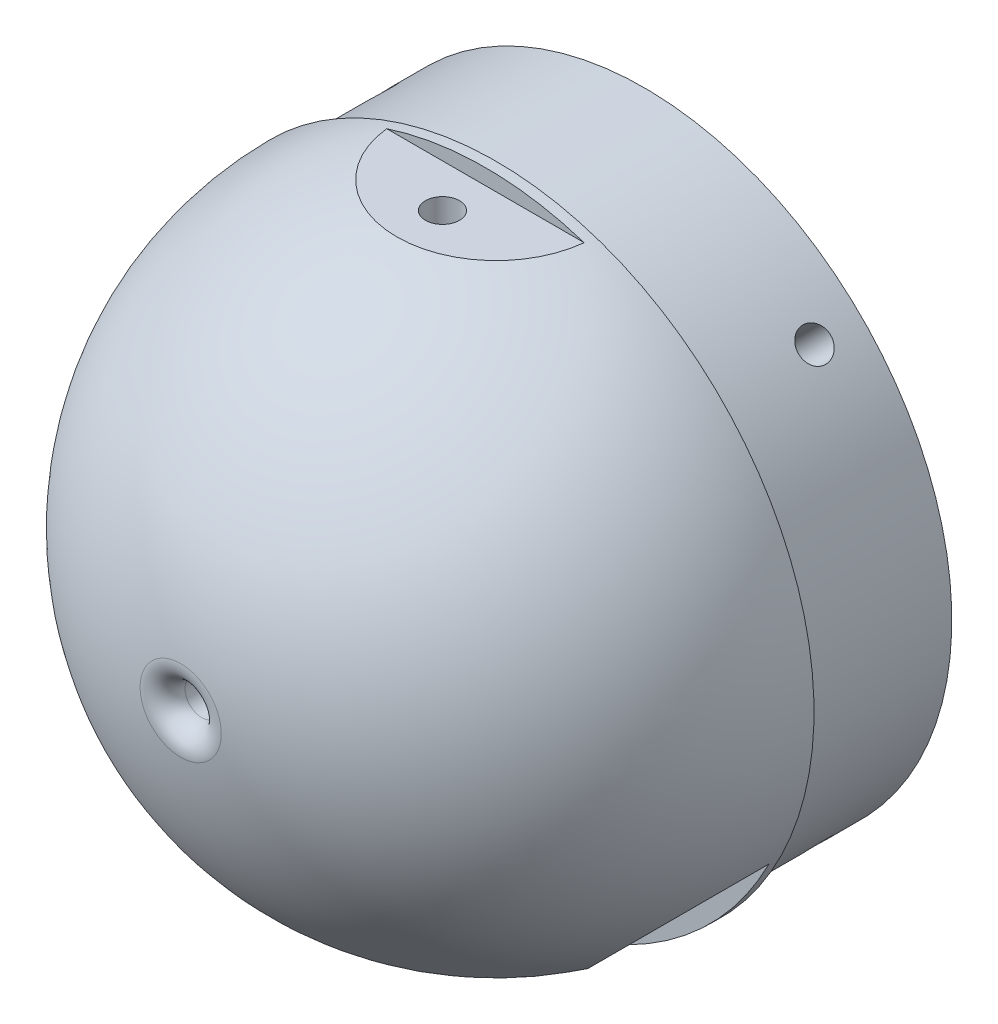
ISO-10303-21;
HEADER;
FILE_DESCRIPTION(('STEP AP214'),'2;1');
FILE_NAME('part.step','',(''),(''),'','','');
FILE_SCHEMA(('AUTOMOTIVE_DESIGN { 1 0 10303 214 1 1 1 1 }'));
ENDSEC;
DATA;
#1=APPLICATION_CONTEXT('core data for automotive mechanical design processes');
#2=APPLICATION_PROTOCOL_DEFINITION('international standard','automotive_design',2000,#1);
#3=PRODUCT_CONTEXT('',#1,'mechanical');
#4=PRODUCT('Part','Part','',(#3));
#5=PRODUCT_RELATED_PRODUCT_CATEGORY('part','',(#4));
#6=PRODUCT_DEFINITION_FORMATION('','',#4);
#7=PRODUCT_DEFINITION_CONTEXT('part definition',#1,'design');
#8=PRODUCT_DEFINITION('design','',#6,#7);
#9=PRODUCT_DEFINITION_SHAPE('','',#8);
#10=(LENGTH_UNIT() NAMED_UNIT(*) SI_UNIT(.MILLI.,.METRE.));
#11=(NAMED_UNIT(*) PLANE_ANGLE_UNIT() SI_UNIT($,.RADIAN.));
#12=(NAMED_UNIT(*) SI_UNIT($,.STERADIAN.) SOLID_ANGLE_UNIT());
#13=UNCERTAINTY_MEASURE_WITH_UNIT(LENGTH_MEASURE(1.E-05),#10,'distance_accuracy_value','');
#14=(GEOMETRIC_REPRESENTATION_CONTEXT(3) GLOBAL_UNCERTAINTY_ASSIGNED_CONTEXT((#13)) GLOBAL_UNIT_ASSIGNED_CONTEXT((#10,
#11,#12)) REPRESENTATION_CONTEXT('',''));
#15=CARTESIAN_POINT('',(0.,0.,0.));
#16=DIRECTION('',(0.,0.,1.));
#17=DIRECTION('',(1.,0.,0.));
#18=AXIS2_PLACEMENT_3D('',#15,#16,#17);
#19=CARTESIAN_POINT('',(0.,0.,-15.125));
#20=DIRECTION('',(0.,0.,1.));
#21=DIRECTION('',(0.,-1.,0.));
#22=AXIS2_PLACEMENT_3D('',#19,#20,#21);
#23=SPHERICAL_SURFACE('',#22,47.625);
#24=CARTESIAN_POINT('',(31.9876723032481,-31.9876723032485,-15.125));
#25=DIRECTION('',(0.707106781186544,-0.707106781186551,0.));
#26=DIRECTION('',(0.707106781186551,0.707106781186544,0.));
#27=AXIS2_PLACEMENT_3D('',#24,#25,#26);
#28=CIRCLE('',#27,14.8902070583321);
#29=CARTESIAN_POINT('',(21.5187155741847,-42.4566290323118,-13.5375));
#30=VERTEX_POINT('',#29);
#31=CARTESIAN_POINT('',(42.4566290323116,-21.5187155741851,-13.5375));
#32=VERTEX_POINT('',#31);
#33=EDGE_CURVE('E219',#30,#32,#28,.F.);
#34=ORIENTED_EDGE('',*,*,#33,.T.);
#35=CARTESIAN_POINT('',(0.,0.,-13.5375));
#36=DIRECTION('',(0.,0.,1.));
#37=DIRECTION('',(1.,0.,0.));
#38=AXIS2_PLACEMENT_3D('',#35,#36,#37);
#39=CIRCLE('',#38,47.5985343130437);
#40=EDGE_CURVE('E297',#32,#30,#39,.F.);
#41=ORIENTED_EDGE('',*,*,#40,.T.);
#42=EDGE_LOOP('',(#34,#41));
#43=FACE_BOUND('',#42,.T.);
#44=CARTESIAN_POINT('',(0.,0.,-13.5375));
#45=DIRECTION('',(0.,0.,-1.));
#46=DIRECTION('',(0.,1.,0.));
#47=AXIS2_PLACEMENT_3D('',#44,#45,#46);
#48=CIRCLE('',#47,47.5985343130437);
#49=CARTESIAN_POINT('',(14.785924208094,45.24375,-13.5375));
#50=VERTEX_POINT('',#49);
#51=CARTESIAN_POINT('',(-14.785924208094,45.24375,-13.5375));
#52=VERTEX_POINT('',#51);
#53=EDGE_CURVE('E220',#50,#52,#48,.F.);
#54=ORIENTED_EDGE('',*,*,#53,.F.);
#55=CARTESIAN_POINT('',(0.,45.24375,-15.125));
#56=DIRECTION('',(0.,-1.,0.));
#57=DIRECTION('',(0.,0.,-1.));
#58=AXIS2_PLACEMENT_3D('',#55,#56,#57);
#59=CIRCLE('',#58,14.8709014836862);
#60=EDGE_CURVE('E286',#52,#50,#59,.F.);
#61=ORIENTED_EDGE('',*,*,#60,.F.);
#62=EDGE_LOOP('',(#54,#61));
#63=FACE_BOUND('',#62,.T.);
#64=CARTESIAN_POINT('',(0.,0.,32.1102610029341));
#65=DIRECTION('',(0.,0.,-1.));
#66=DIRECTION('',(0.,1.,0.));
#67=AXIS2_PLACEMENT_3D('',#64,#65,#66);
#68=CIRCLE('',#67,6.08035714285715);
#69=CARTESIAN_POINT('',(0.,6.08035714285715,32.1102610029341));
#70=VERTEX_POINT('',#69);
#71=EDGE_CURVE('E281',#70,#70,#68,.T.);
#72=ORIENTED_EDGE('',*,*,#71,.T.);
#73=EDGE_LOOP('',(#72));
#74=FACE_BOUND('',#73,.T.);
#75=CARTESIAN_POINT('',(0.,0.,-15.125));
#76=DIRECTION('',(0.,0.,-1.));
#77=DIRECTION('',(-1.,0.,0.));
#78=AXIS2_PLACEMENT_3D('',#75,#76,#77);
#79=CIRCLE('',#78,47.625);
#80=CARTESIAN_POINT('',(-47.625,0.,-15.125));
#81=VERTEX_POINT('',#80);
#82=EDGE_CURVE('E260',#81,#81,#79,.F.);
#83=ORIENTED_EDGE('',*,*,#82,.T.);
#84=EDGE_LOOP('',(#83));
#85=FACE_BOUND('',#84,.T.);
#86=CARTESIAN_POINT('',(-31.9876723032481,-31.9876723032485,-15.125));
#87=DIRECTION('',(-0.707106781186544,-0.707106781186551,0.));
#88=DIRECTION('',(0.707106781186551,-0.707106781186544,0.));
#89=AXIS2_PLACEMENT_3D('',#86,#87,#88);
#90=CIRCLE('',#89,14.8902070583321);
#91=CARTESIAN_POINT('',(-42.4566290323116,-21.5187155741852,-13.5375));
#92=VERTEX_POINT('',#91);
#93=CARTESIAN_POINT('',(-21.5187155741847,-42.4566290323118,-13.5375));
#94=VERTEX_POINT('',#93);
#95=EDGE_CURVE('E50',#92,#94,#90,.F.);
#96=ORIENTED_EDGE('',*,*,#95,.T.);
#97=CARTESIAN_POINT('',(0.,0.,-13.5375));
#98=DIRECTION('',(0.,0.,1.));
#99=DIRECTION('',(1.,0.,0.));
#100=AXIS2_PLACEMENT_3D('',#97,#98,#99);
#101=CIRCLE('',#100,47.5985343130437);
#102=EDGE_CURVE('E12',#94,#92,#101,.F.);
#103=ORIENTED_EDGE('',*,*,#102,.T.);
#104=EDGE_LOOP('',(#96,#103));
#105=FACE_BOUND('',#104,.T.);
#106=ADVANCED_FACE('F42',(#43,#63,#74,#85,#105),#23,.T.);
#107=CARTESIAN_POINT('',(0.,47.625,-37.35));
#108=DIRECTION('',(0.,0.,1.));
#109=DIRECTION('',(1.,0.,0.));
#110=AXIS2_PLACEMENT_3D('',#107,#108,#109);
#111=PLANE('',#110);
#112=CARTESIAN_POINT('',(0.,0.,-37.35));
#113=DIRECTION('',(0.,0.,1.));
#114=DIRECTION('',(1.,0.,0.));
#115=AXIS2_PLACEMENT_3D('',#112,#113,#114);
#116=CIRCLE('',#115,4.);
#117=CARTESIAN_POINT('',(4.,0.,-37.35));
#118=VERTEX_POINT('',#117);
#119=EDGE_CURVE('E263',#118,#118,#116,.T.);
#120=ORIENTED_EDGE('',*,*,#119,.T.);
#121=EDGE_LOOP('',(#120));
#122=FACE_BOUND('',#121,.T.);
#123=CARTESIAN_POINT('',(0.,0.,-37.35));
#124=DIRECTION('',(0.,0.,-1.));
#125=DIRECTION('',(-1.,0.,0.));
#126=AXIS2_PLACEMENT_3D('',#123,#124,#125);
#127=CIRCLE('',#126,46.0375);
#128=CARTESIAN_POINT('',(-46.0375,0.,-37.35));
#129=VERTEX_POINT('',#128);
#130=EDGE_CURVE('E247',#129,#129,#127,.T.);
#131=ORIENTED_EDGE('',*,*,#130,.T.);
#132=EDGE_LOOP('',(#131));
#133=FACE_BOUND('',#132,.T.);
#134=ADVANCED_FACE('F165',(#122,#133),#111,.F.);
#135=CARTESIAN_POINT('',(0.,0.,32.476372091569));
#136=DIRECTION('',(0.,0.,1.));
#137=DIRECTION('',(0.,-1.,0.));
#138=AXIS2_PLACEMENT_3D('',#135,#136,#137);
#139=CYLINDRICAL_SURFACE('',#138,4.);
#140=CARTESIAN_POINT('',(0.,0.,-12.5));
#141=DIRECTION('',(0.,0.,1.));
#142=DIRECTION('',(0.,-1.,0.));
#143=AXIS2_PLACEMENT_3D('',#140,#141,#142);
#144=CIRCLE('',#143,4.);
#145=CARTESIAN_POINT('',(0.,-4.,-12.5));
#146=VERTEX_POINT('',#145);
#147=EDGE_CURVE('E275',#146,#146,#144,.T.);
#148=ORIENTED_EDGE('',*,*,#147,.T.);
#149=EDGE_LOOP('',(#148));
#150=FACE_BOUND('',#149,.T.);
#151=ORIENTED_EDGE('',*,*,#119,.F.);
#152=EDGE_LOOP('',(#151));
#153=FACE_BOUND('',#152,.T.);
#154=ADVANCED_FACE('F170',(#150,#153),#139,.F.);
#155=CARTESIAN_POINT('',(0.,0.,32.476372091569));
#156=DIRECTION('',(0.,0.,1.));
#157=DIRECTION('',(0.,-1.,0.));
#158=AXIS2_PLACEMENT_3D('',#155,#156,#157);
#159=CYLINDRICAL_SURFACE('',#158,2.50000000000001);
#160=CARTESIAN_POINT('',(0.,0.,28.9612436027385));
#161=DIRECTION('',(0.,0.,-1.));
#162=DIRECTION('',(0.,1.,0.));
#163=AXIS2_PLACEMENT_3D('',#160,#161,#162);
#164=CIRCLE('',#163,2.50000000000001);
#165=CARTESIAN_POINT('',(0.,2.50000000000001,28.9612436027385));
#166=VERTEX_POINT('',#165);
#167=EDGE_CURVE('E284',#166,#166,#164,.F.);
#168=ORIENTED_EDGE('',*,*,#167,.T.);
#169=EDGE_LOOP('',(#168));
#170=FACE_BOUND('',#169,.T.);
#171=CARTESIAN_POINT('',(0.,0.,-12.5));
#172=DIRECTION('',(0.,0.,1.));
#173=DIRECTION('',(0.,-1.,0.));
#174=AXIS2_PLACEMENT_3D('',#171,#172,#173);
#175=CIRCLE('',#174,2.50000000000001);
#176=CARTESIAN_POINT('',(0.,-2.50000000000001,-12.5));
#177=VERTEX_POINT('',#176);
#178=EDGE_CURVE('E278',#177,#177,#175,.T.);
#179=ORIENTED_EDGE('',*,*,#178,.F.);
#180=EDGE_LOOP('',(#179));
#181=FACE_BOUND('',#180,.T.);
#182=ADVANCED_FACE('F178',(#170,#181),#159,.F.);
#183=CARTESIAN_POINT('',(0.,4.,-12.5));
#184=DIRECTION('',(0.,0.,-1.));
#185=DIRECTION('',(0.,1.,0.));
#186=AXIS2_PLACEMENT_3D('',#183,#184,#185);
#187=PLANE('',#186);
#188=ORIENTED_EDGE('',*,*,#178,.T.);
#189=EDGE_LOOP('',(#188));
#190=FACE_BOUND('',#189,.T.);
#191=ORIENTED_EDGE('',*,*,#147,.F.);
#192=EDGE_LOOP('',(#191));
#193=FACE_BOUND('',#192,.T.);
#194=ADVANCED_FACE('F182',(#190,#193),#187,.T.);
#195=CARTESIAN_POINT('',(0.,0.,28.9612436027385));
#196=DIRECTION('',(0.,0.,-1.));
#197=DIRECTION('',(0.,1.,0.));
#198=AXIS2_PLACEMENT_3D('',#195,#196,#197);
#199=TOROIDAL_SURFACE('',#198,5.67500000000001,3.175);
#200=ORIENTED_EDGE('',*,*,#167,.F.);
#201=EDGE_LOOP('',(#200));
#202=FACE_BOUND('',#201,.T.);
#203=ORIENTED_EDGE('',*,*,#71,.F.);
#204=EDGE_LOOP('',(#203));
#205=FACE_BOUND('',#204,.T.);
#206=ADVANCED_FACE('F44',(#202,#205),#199,.T.);
#207=CARTESIAN_POINT('',(-25.4,51.59375,-13.5375));
#208=DIRECTION('',(0.,0.,-1.));
#209=DIRECTION('',(0.,1.,0.));
#210=AXIS2_PLACEMENT_3D('',#207,#208,#209);
#211=PLANE('',#210);
#212=ORIENTED_EDGE('',*,*,#53,.T.);
#213=DIRECTION('',(1.,0.,0.));
#214=VECTOR('',#213,1.);
#215=CARTESIAN_POINT('',(-25.4,45.24375,-13.5375));
#216=LINE('',#215,#214);
#217=EDGE_CURVE('E272',#52,#50,#216,.T.);
#218=ORIENTED_EDGE('',*,*,#217,.T.);
#219=EDGE_LOOP('',(#212,#218));
#220=FACE_BOUND('',#219,.T.);
#221=ADVANCED_FACE('F191',(#220),#211,.F.);
#222=CARTESIAN_POINT('',(-25.4,45.24375,11.8625));
#223=DIRECTION('',(0.,-1.,0.));
#224=DIRECTION('',(0.,0.,-1.));
#225=AXIS2_PLACEMENT_3D('',#222,#223,#224);
#226=PLANE('',#225);
#227=CARTESIAN_POINT('',(0.,45.24375,-7.10113999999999));
#228=DIRECTION('',(0.,1.,0.));
#229=DIRECTION('',(0.,0.,1.));
#230=AXIS2_PLACEMENT_3D('',#227,#228,#229);
#231=CIRCLE('',#230,2.55269999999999);
#232=CARTESIAN_POINT('',(0.,45.24375,-4.54844));
#233=VERTEX_POINT('',#232);
#234=EDGE_CURVE('E266',#233,#233,#231,.T.);
#235=ORIENTED_EDGE('',*,*,#234,.F.);
#236=EDGE_LOOP('',(#235));
#237=FACE_BOUND('',#236,.T.);
#238=ORIENTED_EDGE('',*,*,#60,.T.);
#239=ORIENTED_EDGE('',*,*,#217,.F.);
#240=EDGE_LOOP('',(#238,#239));
#241=FACE_BOUND('',#240,.T.);
#242=ADVANCED_FACE('F187',(#237,#241),#226,.F.);
#243=CARTESIAN_POINT('',(0.,26.19375,-7.10113999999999));
#244=DIRECTION('',(0.,1.,0.));
#245=DIRECTION('',(0.,0.,1.));
#246=AXIS2_PLACEMENT_3D('',#243,#244,#245);
#247=CONICAL_SURFACE('',#246,2.55269999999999,1.02974425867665);
#248=CARTESIAN_POINT('',(0.,24.6599330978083,-7.10113999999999));
#249=VERTEX_POINT('',#248);
#250=VERTEX_LOOP('',#249);
#251=FACE_BOUND('',#250,.T.);
#252=CARTESIAN_POINT('',(0.,26.19375,-7.10113999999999));
#253=DIRECTION('',(0.,1.,0.));
#254=DIRECTION('',(0.,0.,1.));
#255=AXIS2_PLACEMENT_3D('',#252,#253,#254);
#256=CIRCLE('',#255,2.55269999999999);
#257=CARTESIAN_POINT('',(0.,26.19375,-4.54844));
#258=VERTEX_POINT('',#257);
#259=EDGE_CURVE('E269',#258,#258,#256,.T.);
#260=ORIENTED_EDGE('',*,*,#259,.T.);
#261=EDGE_LOOP('',(#260));
#262=FACE_BOUND('',#261,.T.);
#263=ADVANCED_FACE('F190',(#251,#262),#247,.F.);
#264=CARTESIAN_POINT('',(0.,45.24375,-7.10113999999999));
#265=DIRECTION('',(0.,1.,0.));
#266=DIRECTION('',(0.,0.,1.));
#267=AXIS2_PLACEMENT_3D('',#264,#265,#266);
#268=CYLINDRICAL_SURFACE('',#267,2.55269999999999);
#269=ORIENTED_EDGE('',*,*,#259,.F.);
#270=EDGE_LOOP('',(#269));
#271=FACE_BOUND('',#270,.T.);
#272=ORIENTED_EDGE('',*,*,#234,.T.);
#273=EDGE_LOOP('',(#272));
#274=FACE_BOUND('',#273,.T.);
#275=ADVANCED_FACE('F198',(#271,#274),#268,.F.);
#276=CARTESIAN_POINT('',(0.,50.8,-15.125));
#277=DIRECTION('',(0.,0.,-1.));
#278=DIRECTION('',(-1.,0.,0.));
#279=AXIS2_PLACEMENT_3D('',#276,#277,#278);
#280=PLANE('',#279);
#281=ORIENTED_EDGE('',*,*,#82,.F.);
#282=EDGE_LOOP('',(#281));
#283=FACE_BOUND('',#282,.T.);
#284=CARTESIAN_POINT('',(0.,0.,-15.125));
#285=DIRECTION('',(0.,0.,-1.));
#286=DIRECTION('',(-1.,0.,0.));
#287=AXIS2_PLACEMENT_3D('',#284,#285,#286);
#288=CIRCLE('',#287,46.0375);
#289=CARTESIAN_POINT('',(-46.0375,0.,-15.125));
#290=VERTEX_POINT('',#289);
#291=EDGE_CURVE('E251',#290,#290,#288,.F.);
#292=ORIENTED_EDGE('',*,*,#291,.T.);
#293=EDGE_LOOP('',(#292));
#294=FACE_BOUND('',#293,.T.);
#295=ADVANCED_FACE('F202',(#283,#294),#280,.T.);
#296=CARTESIAN_POINT('',(0.,0.,129.995938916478));
#297=DIRECTION('',(0.,0.,-1.));
#298=DIRECTION('',(-1.,0.,0.));
#299=AXIS2_PLACEMENT_3D('',#296,#297,#298);
#300=CYLINDRICAL_SURFACE('',#299,46.0375);
#301=CARTESIAN_POINT('',(-30.8024335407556,-34.2149308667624,-30.2786400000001));
#302=CARTESIAN_POINT('',(-30.8024383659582,-34.2149272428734,-30.1432006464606));
#303=CARTESIAN_POINT('',(-30.8109516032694,-34.2072683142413,-30.0076654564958));
#304=CARTESIAN_POINT('',(-30.8447564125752,-34.1767889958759,-29.7403346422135));
#305=CARTESIAN_POINT('',(-30.8700677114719,-34.1539507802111,-29.6085436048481));
#306=CARTESIAN_POINT('',(-30.9366366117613,-34.0936640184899,-29.3526122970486));
#307=CARTESIAN_POINT('',(-30.97788603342,-34.0562229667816,-29.2284681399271));
#308=CARTESIAN_POINT('',(-31.0749871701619,-33.9676445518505,-28.9913154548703));
#309=CARTESIAN_POINT('',(-31.130835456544,-33.9165104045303,-28.8783043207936));
#310=CARTESIAN_POINT('',(-31.2554184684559,-33.8017363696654,-28.6664680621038));
#311=CARTESIAN_POINT('',(-31.3241655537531,-33.7380844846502,-28.5676567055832));
#312=CARTESIAN_POINT('',(-31.4723537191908,-33.5998898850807,-28.3871423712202));
#313=CARTESIAN_POINT('',(-31.5517952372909,-33.5253467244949,-28.3054400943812));
#314=CARTESIAN_POINT('',(-31.7189638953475,-33.3672288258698,-28.1614244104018));
#315=CARTESIAN_POINT('',(-31.8066956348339,-33.2836490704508,-28.0991218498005));
#316=CARTESIAN_POINT('',(-31.987743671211,-33.1096874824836,-27.9957437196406));
#317=CARTESIAN_POINT('',(-32.081059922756,-33.0193057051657,-27.9546679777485));
#318=CARTESIAN_POINT('',(-32.2704128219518,-32.8342711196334,-27.8949461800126));
#319=CARTESIAN_POINT('',(-32.3664468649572,-32.7396223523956,-27.8762793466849));
#320=CARTESIAN_POINT('',(-32.5585287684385,-32.5486090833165,-27.8618411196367));
#321=CARTESIAN_POINT('',(-32.6545766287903,-32.4522445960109,-27.8660695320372));
#322=CARTESIAN_POINT('',(-32.8438741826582,-32.2606487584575,-27.8972845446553));
#323=CARTESIAN_POINT('',(-32.9371265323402,-32.1654163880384,-27.9242487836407));
#324=CARTESIAN_POINT('',(-33.1183710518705,-31.9787716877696,-28.0001353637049));
#325=CARTESIAN_POINT('',(-33.2063631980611,-31.887359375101,-28.0490578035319));
#326=CARTESIAN_POINT('',(-33.3747830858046,-31.7110414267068,-28.1674975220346));
#327=CARTESIAN_POINT('',(-33.4552070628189,-31.6261390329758,-28.2370249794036));
#328=CARTESIAN_POINT('',(-33.6063579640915,-31.4654778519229,-28.3946936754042));
#329=CARTESIAN_POINT('',(-33.6770848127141,-31.3897191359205,-28.4828350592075));
#330=CARTESIAN_POINT('',(-33.8071343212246,-31.2496119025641,-28.6753559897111));
#331=CARTESIAN_POINT('',(-33.866443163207,-31.1852772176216,-28.7797549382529));
#332=CARTESIAN_POINT('',(-33.9720815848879,-31.0701657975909,-29.001759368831));
#333=CARTESIAN_POINT('',(-34.0184111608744,-31.0193890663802,-29.1193648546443));
#334=CARTESIAN_POINT('',(-34.0969626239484,-30.9330239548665,-29.36445588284));
#335=CARTESIAN_POINT('',(-34.1291839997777,-30.8974361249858,-29.4919417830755));
#336=CARTESIAN_POINT('',(-34.1787379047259,-30.8426110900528,-29.7531693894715));
#337=CARTESIAN_POINT('',(-34.1960705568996,-30.8233737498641,-29.8869110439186));
#338=CARTESIAN_POINT('',(-34.2154193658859,-30.8018943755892,-30.1566833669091));
#339=CARTESIAN_POINT('',(-34.2174537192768,-30.7996321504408,-30.292711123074));
#340=CARTESIAN_POINT('',(-34.206205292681,-30.8121241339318,-30.5633440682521));
#341=CARTESIAN_POINT('',(-34.1929225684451,-30.8268782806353,-30.6979492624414));
#342=CARTESIAN_POINT('',(-34.1513700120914,-30.8729053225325,-30.9618397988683));
#343=CARTESIAN_POINT('',(-34.1231085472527,-30.904168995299,-31.0911280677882));
#344=CARTESIAN_POINT('',(-34.0522827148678,-30.9821917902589,-31.3408049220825));
#345=CARTESIAN_POINT('',(-34.009718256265,-31.0289510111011,-31.4611934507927));
#346=CARTESIAN_POINT('',(-33.9112710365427,-31.1365123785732,-31.6897782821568));
#347=CARTESIAN_POINT('',(-33.8553757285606,-31.1973277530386,-31.7979629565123));
#348=CARTESIAN_POINT('',(-33.7316636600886,-31.3310476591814,-31.9989521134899));
#349=CARTESIAN_POINT('',(-33.6638468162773,-31.4039522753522,-32.0917564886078));
#350=CARTESIAN_POINT('',(-33.5179226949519,-31.5596520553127,-32.2594419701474));
#351=CARTESIAN_POINT('',(-33.4398054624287,-31.6424567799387,-32.3343055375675));
#352=CARTESIAN_POINT('',(-33.275346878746,-31.8153565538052,-32.4638643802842));
#353=CARTESIAN_POINT('',(-33.1890055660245,-31.9054515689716,-32.5185597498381));
#354=CARTESIAN_POINT('',(-33.0104365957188,-32.0901692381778,-32.6061989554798));
#355=CARTESIAN_POINT('',(-32.9182119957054,-32.1847895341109,-32.6391539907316));
#356=CARTESIAN_POINT('',(-32.7303569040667,-32.375810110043,-32.68241372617));
#357=CARTESIAN_POINT('',(-32.6347264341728,-32.472210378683,-32.6927185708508));
#358=CARTESIAN_POINT('',(-32.4428648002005,-32.6638989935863,-32.6903840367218));
#359=CARTESIAN_POINT('',(-32.3466344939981,-32.7591885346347,-32.6777721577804));
#360=CARTESIAN_POINT('',(-32.1562313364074,-32.9461074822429,-32.6300190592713));
#361=CARTESIAN_POINT('',(-32.0620584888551,-33.0377368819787,-32.5948777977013));
#362=CARTESIAN_POINT('',(-31.8785465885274,-33.2148453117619,-32.5030692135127));
#363=CARTESIAN_POINT('',(-31.789207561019,-33.3003243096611,-32.4464017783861));
#364=CARTESIAN_POINT('',(-31.6180547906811,-33.4628744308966,-32.3131539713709));
#365=CARTESIAN_POINT('',(-31.5362408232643,-33.5399458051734,-32.2365741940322));
#366=CARTESIAN_POINT('',(-31.3825593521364,-33.6837866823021,-32.0655762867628));
#367=CARTESIAN_POINT('',(-31.3107027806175,-33.7505448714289,-31.9711388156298));
#368=CARTESIAN_POINT('',(-31.1792726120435,-33.8720001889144,-31.767122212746));
#369=CARTESIAN_POINT('',(-31.1197020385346,-33.9266943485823,-31.6575393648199));
#370=CARTESIAN_POINT('',(-31.0147093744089,-34.0227025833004,-31.4262496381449));
#371=CARTESIAN_POINT('',(-30.9693016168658,-34.0640031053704,-31.3045306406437));
#372=CARTESIAN_POINT('',(-30.8942259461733,-34.1321080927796,-31.0526016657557));
#373=CARTESIAN_POINT('',(-30.8645394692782,-34.1589296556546,-30.9224019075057));
#374=CARTESIAN_POINT('',(-30.8296478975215,-34.1904156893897,-30.7059361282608));
#375=CARTESIAN_POINT('',(-30.8194571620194,-34.1995987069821,-30.6210717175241));
#376=CARTESIAN_POINT('',(-30.8058484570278,-34.2118574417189,-30.4503643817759));
#377=CARTESIAN_POINT('',(-30.8024304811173,-34.2149331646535,-30.3645214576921));
#378=CARTESIAN_POINT('',(-30.8024335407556,-34.2149308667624,-30.2786400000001));
#379=B_SPLINE_CURVE_WITH_KNOTS('',3,(#301,#302,#303,#304,#305,#306,#307,#308,#309,#310,#311,
#312,#313,#314,#315,#316,#317,#318,#319,#320,#321,#322,#323,#324,#325,#326,#327,#328,#329,#330,
#331,#332,#333,#334,#335,#336,#337,#338,#339,#340,#341,#342,#343,#344,#345,#346,#347,#348,#349,
#350,#351,#352,#353,#354,#355,#356,#357,#358,#359,#360,#361,#362,#363,#364,#365,#366,#367,#368,
#369,#370,#371,#372,#373,#374,#375,#376,#377,#378),.UNSPECIFIED.,.T.,.F.,(4,2,2,2,2,2,2,2,2,2,2,
2,2,2,2,2,2,2,2,2,2,2,2,2,2,2,2,2,2,2,2,2,2,2,2,2,2,2,4),(0.,0.406004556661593,
0.812486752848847,1.21876061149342,1.62493913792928,2.03150887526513,2.43809526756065,
2.84490857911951,3.251718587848,3.65815111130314,4.06458019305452,4.4706100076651,
4.87664164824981,5.28287420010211,5.68910992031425,6.09583421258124,6.50255862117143,
6.90929776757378,7.3160335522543,7.72228546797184,8.12853590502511,8.53455964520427,
8.94058597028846,9.34699596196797,9.7534087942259,10.1602173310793,10.567023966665,
10.973620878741,11.3802151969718,11.7863219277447,12.1924294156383,12.5985390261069,
13.0046365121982,13.4111763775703,13.8178161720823,14.224866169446,14.6314344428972,
14.8888802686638,15.1463258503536),.UNSPECIFIED.);
#380=CARTESIAN_POINT('',(-30.8024335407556,-34.2149308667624,-30.2786400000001));
#381=VERTEX_POINT('',#380);
#382=EDGE_CURVE('E127',#381,#381,#379,.T.);
#383=ORIENTED_EDGE('',*,*,#382,.F.);
#384=EDGE_LOOP('',(#383));
#385=FACE_BOUND('',#384,.T.);
#386=CARTESIAN_POINT('',(-34.2149308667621,30.802433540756,-30.2786400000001));
#387=CARTESIAN_POINT('',(-34.214927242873,30.8024383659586,-30.1432006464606));
#388=CARTESIAN_POINT('',(-34.207268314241,30.8109516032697,-30.0076654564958));
#389=CARTESIAN_POINT('',(-34.1767889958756,30.8447564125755,-29.7403346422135));
#390=CARTESIAN_POINT('',(-34.1539507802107,30.8700677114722,-29.6085436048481));
#391=CARTESIAN_POINT('',(-34.0936640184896,30.9366366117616,-29.3526122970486));
#392=CARTESIAN_POINT('',(-34.0562229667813,30.9778860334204,-29.2284681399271));
#393=CARTESIAN_POINT('',(-33.9676445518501,31.0749871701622,-28.9913154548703));
#394=CARTESIAN_POINT('',(-33.91651040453,31.1308354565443,-28.8783043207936));
#395=CARTESIAN_POINT('',(-33.8017363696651,31.2554184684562,-28.6664680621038));
#396=CARTESIAN_POINT('',(-33.7380844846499,31.3241655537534,-28.5676567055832));
#397=CARTESIAN_POINT('',(-33.5998898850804,31.4723537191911,-28.3871423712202));
#398=CARTESIAN_POINT('',(-33.5253467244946,31.5517952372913,-28.3054400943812));
#399=CARTESIAN_POINT('',(-33.3672288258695,31.7189638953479,-28.1614244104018));
#400=CARTESIAN_POINT('',(-33.2836490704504,31.8066956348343,-28.0991218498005));
#401=CARTESIAN_POINT('',(-33.1096874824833,31.9877436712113,-27.9957437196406));
#402=CARTESIAN_POINT('',(-33.0193057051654,32.0810599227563,-27.9546679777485));
#403=CARTESIAN_POINT('',(-32.8342711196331,32.2704128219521,-27.8949461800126));
#404=CARTESIAN_POINT('',(-32.7396223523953,32.3664468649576,-27.8762793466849));
#405=CARTESIAN_POINT('',(-32.5486090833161,32.5585287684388,-27.8618411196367));
#406=CARTESIAN_POINT('',(-32.4522445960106,32.6545766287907,-27.8660695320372));
#407=CARTESIAN_POINT('',(-32.2606487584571,32.8438741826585,-27.8972845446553));
#408=CARTESIAN_POINT('',(-32.1654163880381,32.9371265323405,-27.9242487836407));
#409=CARTESIAN_POINT('',(-31.9787716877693,33.1183710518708,-28.0001353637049));
#410=CARTESIAN_POINT('',(-31.8873593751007,33.2063631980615,-28.0490578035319));
#411=CARTESIAN_POINT('',(-31.7110414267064,33.374783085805,-28.1674975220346));
#412=CARTESIAN_POINT('',(-31.6261390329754,33.4552070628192,-28.2370249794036));
#413=CARTESIAN_POINT('',(-31.4654778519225,33.6063579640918,-28.3946936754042));
#414=CARTESIAN_POINT('',(-31.3897191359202,33.6770848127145,-28.4828350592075));
#415=CARTESIAN_POINT('',(-31.2496119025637,33.8071343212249,-28.6753559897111));
#416=CARTESIAN_POINT('',(-31.1852772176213,33.8664431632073,-28.7797549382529));
#417=CARTESIAN_POINT('',(-31.0701657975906,33.9720815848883,-29.001759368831));
#418=CARTESIAN_POINT('',(-31.0193890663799,34.0184111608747,-29.1193648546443));
#419=CARTESIAN_POINT('',(-30.9330239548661,34.0969626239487,-29.36445588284));
#420=CARTESIAN_POINT('',(-30.8974361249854,34.1291839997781,-29.4919417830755));
#421=CARTESIAN_POINT('',(-30.8426110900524,34.1787379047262,-29.7531693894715));
#422=CARTESIAN_POINT('',(-30.8233737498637,34.1960705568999,-29.8869110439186));
#423=CARTESIAN_POINT('',(-30.8018943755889,34.2154193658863,-30.1566833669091));
#424=CARTESIAN_POINT('',(-30.7996321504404,34.2174537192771,-30.292711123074));
#425=CARTESIAN_POINT('',(-30.8121241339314,34.2062052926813,-30.5633440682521));
#426=CARTESIAN_POINT('',(-30.826878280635,34.1929225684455,-30.6979492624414));
#427=CARTESIAN_POINT('',(-30.8729053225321,34.1513700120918,-30.9618397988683));
#428=CARTESIAN_POINT('',(-30.9041689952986,34.123108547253,-31.0911280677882));
#429=CARTESIAN_POINT('',(-30.9821917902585,34.0522827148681,-31.3408049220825));
#430=CARTESIAN_POINT('',(-31.0289510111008,34.0097182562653,-31.4611934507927));
#431=CARTESIAN_POINT('',(-31.1365123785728,33.9112710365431,-31.6897782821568));
#432=CARTESIAN_POINT('',(-31.1973277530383,33.8553757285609,-31.7979629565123));
#433=CARTESIAN_POINT('',(-31.331047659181,33.731663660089,-31.9989521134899));
#434=CARTESIAN_POINT('',(-31.4039522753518,33.6638468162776,-32.0917564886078));
#435=CARTESIAN_POINT('',(-31.5596520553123,33.5179226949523,-32.2594419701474));
#436=CARTESIAN_POINT('',(-31.6424567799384,33.439805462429,-32.3343055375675));
#437=CARTESIAN_POINT('',(-31.8153565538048,33.2753468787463,-32.4638643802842));
#438=CARTESIAN_POINT('',(-31.9054515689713,33.1890055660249,-32.5185597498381));
#439=CARTESIAN_POINT('',(-32.0901692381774,33.0104365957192,-32.6061989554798));
#440=CARTESIAN_POINT('',(-32.1847895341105,32.9182119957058,-32.6391539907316));
#441=CARTESIAN_POINT('',(-32.3758101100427,32.7303569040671,-32.68241372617));
#442=CARTESIAN_POINT('',(-32.4722103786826,32.6347264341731,-32.6927185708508));
#443=CARTESIAN_POINT('',(-32.663898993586,32.4428648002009,-32.6903840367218));
#444=CARTESIAN_POINT('',(-32.7591885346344,32.3466344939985,-32.6777721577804));
#445=CARTESIAN_POINT('',(-32.9461074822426,32.1562313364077,-32.6300190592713));
#446=CARTESIAN_POINT('',(-33.0377368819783,32.0620584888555,-32.5948777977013));
#447=CARTESIAN_POINT('',(-33.2148453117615,31.8785465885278,-32.5030692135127));
#448=CARTESIAN_POINT('',(-33.3003243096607,31.7892075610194,-32.4464017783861));
#449=CARTESIAN_POINT('',(-33.4628744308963,31.6180547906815,-32.3131539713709));
#450=CARTESIAN_POINT('',(-33.5399458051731,31.5362408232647,-32.2365741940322));
#451=CARTESIAN_POINT('',(-33.6837866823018,31.3825593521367,-32.0655762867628));
#452=CARTESIAN_POINT('',(-33.7505448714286,31.3107027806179,-31.9711388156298));
#453=CARTESIAN_POINT('',(-33.8720001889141,31.1792726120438,-31.767122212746));
#454=CARTESIAN_POINT('',(-33.9266943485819,31.119702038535,-31.6575393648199));
#455=CARTESIAN_POINT('',(-34.0227025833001,31.0147093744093,-31.4262496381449));
#456=CARTESIAN_POINT('',(-34.0640031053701,30.9693016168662,-31.3045306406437));
#457=CARTESIAN_POINT('',(-34.1321080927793,30.8942259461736,-31.0526016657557));
#458=CARTESIAN_POINT('',(-34.1589296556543,30.8645394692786,-30.9224019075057));
#459=CARTESIAN_POINT('',(-34.1904156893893,30.8296478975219,-30.7059361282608));
#460=CARTESIAN_POINT('',(-34.1995987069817,30.8194571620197,-30.6210717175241));
#461=CARTESIAN_POINT('',(-34.2118574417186,30.8058484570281,-30.4503643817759));
#462=CARTESIAN_POINT('',(-34.2149331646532,30.8024304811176,-30.3645214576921));
#463=CARTESIAN_POINT('',(-34.2149308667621,30.802433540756,-30.2786400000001));
#464=B_SPLINE_CURVE_WITH_KNOTS('',3,(#386,#387,#388,#389,#390,#391,#392,#393,#394,#395,#396,
#397,#398,#399,#400,#401,#402,#403,#404,#405,#406,#407,#408,#409,#410,#411,#412,#413,#414,#415,
#416,#417,#418,#419,#420,#421,#422,#423,#424,#425,#426,#427,#428,#429,#430,#431,#432,#433,#434,
#435,#436,#437,#438,#439,#440,#441,#442,#443,#444,#445,#446,#447,#448,#449,#450,#451,#452,#453,
#454,#455,#456,#457,#458,#459,#460,#461,#462,#463),.UNSPECIFIED.,.T.,.F.,(4,2,2,2,2,2,2,2,2,2,2,
2,2,2,2,2,2,2,2,2,2,2,2,2,2,2,2,2,2,2,2,2,2,2,2,2,2,2,4),(0.,0.406004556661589,
0.812486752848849,1.21876061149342,1.62493913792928,2.03150887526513,2.43809526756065,
2.84490857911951,3.251718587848,3.65815111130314,4.06458019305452,4.4706100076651,
4.87664164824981,5.28287420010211,5.68910992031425,6.09583421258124,6.50255862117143,
6.90929776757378,7.3160335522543,7.72228546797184,8.12853590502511,8.53455964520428,
8.94058597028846,9.34699596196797,9.75340879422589,10.1602173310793,10.567023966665,
10.973620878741,11.3802151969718,11.7863219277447,12.1924294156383,12.5985390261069,
13.0046365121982,13.4111763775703,13.8178161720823,14.224866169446,14.6314344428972,
14.8888802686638,15.1463258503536),.UNSPECIFIED.);
#465=CARTESIAN_POINT('',(-34.2149308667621,30.802433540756,-30.2786400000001));
#466=VERTEX_POINT('',#465);
#467=EDGE_CURVE('E672',#466,#466,#464,.T.);
#468=ORIENTED_EDGE('',*,*,#467,.F.);
#469=EDGE_LOOP('',(#468));
#470=FACE_BOUND('',#469,.T.);
#471=CARTESIAN_POINT('',(30.8024335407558,34.2149308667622,-30.2786400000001));
#472=CARTESIAN_POINT('',(30.8024383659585,34.2149272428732,-30.1432006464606));
#473=CARTESIAN_POINT('',(30.8109516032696,34.2072683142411,-30.0076654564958));
#474=CARTESIAN_POINT('',(30.8447564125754,34.1767889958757,-29.7403346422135));
#475=CARTESIAN_POINT('',(30.8700677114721,34.1539507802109,-29.6085436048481));
#476=CARTESIAN_POINT('',(30.9366366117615,34.0936640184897,-29.3526122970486));
#477=CARTESIAN_POINT('',(30.9778860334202,34.0562229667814,-29.2284681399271));
#478=CARTESIAN_POINT('',(31.0749871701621,33.9676445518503,-28.9913154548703));
#479=CARTESIAN_POINT('',(31.1308354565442,33.9165104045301,-28.8783043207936));
#480=CARTESIAN_POINT('',(31.2554184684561,33.8017363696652,-28.6664680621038));
#481=CARTESIAN_POINT('',(31.3241655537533,33.73808448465,-28.5676567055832));
#482=CARTESIAN_POINT('',(31.472353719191,33.5998898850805,-28.3871423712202));
#483=CARTESIAN_POINT('',(31.5517952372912,33.5253467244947,-28.3054400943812));
#484=CARTESIAN_POINT('',(31.7189638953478,33.3672288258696,-28.1614244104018));
#485=CARTESIAN_POINT('',(31.8066956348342,33.2836490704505,-28.0991218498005));
#486=CARTESIAN_POINT('',(31.9877436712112,33.1096874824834,-27.9957437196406));
#487=CARTESIAN_POINT('',(32.0810599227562,33.0193057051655,-27.9546679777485));
#488=CARTESIAN_POINT('',(32.270412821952,32.8342711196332,-27.8949461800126));
#489=CARTESIAN_POINT('',(32.3664468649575,32.7396223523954,-27.8762793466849));
#490=CARTESIAN_POINT('',(32.5585287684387,32.5486090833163,-27.8618411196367));
#491=CARTESIAN_POINT('',(32.6545766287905,32.4522445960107,-27.8660695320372));
#492=CARTESIAN_POINT('',(32.8438741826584,32.2606487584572,-27.8972845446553));
#493=CARTESIAN_POINT('',(32.9371265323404,32.1654163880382,-27.9242487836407));
#494=CARTESIAN_POINT('',(33.1183710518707,31.9787716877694,-28.0001353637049));
#495=CARTESIAN_POINT('',(33.2063631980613,31.8873593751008,-28.0490578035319));
#496=CARTESIAN_POINT('',(33.3747830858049,31.7110414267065,-28.1674975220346));
#497=CARTESIAN_POINT('',(33.4552070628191,31.6261390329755,-28.2370249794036));
#498=CARTESIAN_POINT('',(33.6063579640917,31.4654778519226,-28.3946936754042));
#499=CARTESIAN_POINT('',(33.6770848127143,31.3897191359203,-28.4828350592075));
#500=CARTESIAN_POINT('',(33.8071343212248,31.2496119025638,-28.6753559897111));
#501=CARTESIAN_POINT('',(33.8664431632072,31.1852772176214,-28.7797549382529));
#502=CARTESIAN_POINT('',(33.9720815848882,31.0701657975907,-29.001759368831));
#503=CARTESIAN_POINT('',(34.0184111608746,31.01938906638,-29.1193648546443));
#504=CARTESIAN_POINT('',(34.0969626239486,30.9330239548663,-29.36445588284));
#505=CARTESIAN_POINT('',(34.129183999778,30.8974361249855,-29.4919417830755));
#506=CARTESIAN_POINT('',(34.1787379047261,30.8426110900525,-29.7531693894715));
#507=CARTESIAN_POINT('',(34.1960705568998,30.8233737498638,-29.8869110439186));
#508=CARTESIAN_POINT('',(34.2154193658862,30.801894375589,-30.1566833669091));
#509=CARTESIAN_POINT('',(34.217453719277,30.7996321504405,-30.292711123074));
#510=CARTESIAN_POINT('',(34.2062052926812,30.8121241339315,-30.5633440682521));
#511=CARTESIAN_POINT('',(34.1929225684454,30.8268782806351,-30.6979492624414));
#512=CARTESIAN_POINT('',(34.1513700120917,30.8729053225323,-30.9618397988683));
#513=CARTESIAN_POINT('',(34.1231085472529,30.9041689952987,-31.0911280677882));
#514=CARTESIAN_POINT('',(34.052282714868,30.9821917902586,-31.3408049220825));
#515=CARTESIAN_POINT('',(34.0097182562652,31.0289510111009,-31.4611934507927));
#516=CARTESIAN_POINT('',(33.9112710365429,31.1365123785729,-31.6897782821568));
#517=CARTESIAN_POINT('',(33.8553757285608,31.1973277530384,-31.7979629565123));
#518=CARTESIAN_POINT('',(33.7316636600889,31.3310476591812,-31.9989521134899));
#519=CARTESIAN_POINT('',(33.6638468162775,31.4039522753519,-32.0917564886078));
#520=CARTESIAN_POINT('',(33.5179226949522,31.5596520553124,-32.2594419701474));
#521=CARTESIAN_POINT('',(33.4398054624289,31.6424567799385,-32.3343055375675));
#522=CARTESIAN_POINT('',(33.2753468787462,31.815356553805,-32.4638643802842));
#523=CARTESIAN_POINT('',(33.1890055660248,31.9054515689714,-32.5185597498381));
#524=CARTESIAN_POINT('',(33.0104365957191,32.0901692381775,-32.6061989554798));
#525=CARTESIAN_POINT('',(32.9182119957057,32.1847895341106,-32.6391539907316));
#526=CARTESIAN_POINT('',(32.730356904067,32.3758101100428,-32.68241372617));
#527=CARTESIAN_POINT('',(32.634726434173,32.4722103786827,-32.6927185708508));
#528=CARTESIAN_POINT('',(32.4428648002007,32.6638989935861,-32.6903840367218));
#529=CARTESIAN_POINT('',(32.3466344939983,32.7591885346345,-32.6777721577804));
#530=CARTESIAN_POINT('',(32.1562313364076,32.9461074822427,-32.6300190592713));
#531=CARTESIAN_POINT('',(32.0620584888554,33.0377368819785,-32.5948777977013));
#532=CARTESIAN_POINT('',(31.8785465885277,33.2148453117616,-32.5030692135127));
#533=CARTESIAN_POINT('',(31.7892075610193,33.3003243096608,-32.4464017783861));
#534=CARTESIAN_POINT('',(31.6180547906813,33.4628744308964,-32.3131539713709));
#535=CARTESIAN_POINT('',(31.5362408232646,33.5399458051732,-32.2365741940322));
#536=CARTESIAN_POINT('',(31.3825593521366,33.6837866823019,-32.0655762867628));
#537=CARTESIAN_POINT('',(31.3107027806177,33.7505448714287,-31.9711388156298));
#538=CARTESIAN_POINT('',(31.1792726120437,33.8720001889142,-31.767122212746));
#539=CARTESIAN_POINT('',(31.1197020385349,33.9266943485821,-31.6575393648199));
#540=CARTESIAN_POINT('',(31.0147093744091,34.0227025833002,-31.4262496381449));
#541=CARTESIAN_POINT('',(30.9693016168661,34.0640031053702,-31.3045306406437));
#542=CARTESIAN_POINT('',(30.8942259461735,34.1321080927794,-31.0526016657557));
#543=CARTESIAN_POINT('',(30.8645394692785,34.1589296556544,-30.9224019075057));
#544=CARTESIAN_POINT('',(30.8296478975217,34.1904156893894,-30.7059361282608));
#545=CARTESIAN_POINT('',(30.8194571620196,34.1995987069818,-30.6210717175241));
#546=CARTESIAN_POINT('',(30.805848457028,34.2118574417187,-30.4503643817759));
#547=CARTESIAN_POINT('',(30.8024304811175,34.2149331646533,-30.3645214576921));
#548=CARTESIAN_POINT('',(30.8024335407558,34.2149308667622,-30.2786400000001));
#549=B_SPLINE_CURVE_WITH_KNOTS('',3,(#471,#472,#473,#474,#475,#476,#477,#478,#479,#480,#481,
#482,#483,#484,#485,#486,#487,#488,#489,#490,#491,#492,#493,#494,#495,#496,#497,#498,#499,#500,
#501,#502,#503,#504,#505,#506,#507,#508,#509,#510,#511,#512,#513,#514,#515,#516,#517,#518,#519,
#520,#521,#522,#523,#524,#525,#526,#527,#528,#529,#530,#531,#532,#533,#534,#535,#536,#537,#538,
#539,#540,#541,#542,#543,#544,#545,#546,#547,#548),.UNSPECIFIED.,.T.,.F.,(4,2,2,2,2,2,2,2,2,2,2,
2,2,2,2,2,2,2,2,2,2,2,2,2,2,2,2,2,2,2,2,2,2,2,2,2,2,2,4),(0.,0.406004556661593,
0.812486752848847,1.21876061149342,1.62493913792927,2.03150887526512,2.43809526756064,
2.84490857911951,3.251718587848,3.65815111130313,4.06458019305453,4.47061000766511,
4.87664164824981,5.28287420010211,5.68910992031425,6.09583421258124,6.50255862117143,
6.90929776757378,7.31603355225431,7.72228546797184,8.12853590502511,8.53455964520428,
8.94058597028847,9.34699596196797,9.7534087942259,10.1602173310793,10.567023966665,
10.973620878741,11.3802151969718,11.7863219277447,12.1924294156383,12.5985390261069,
13.0046365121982,13.4111763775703,13.8178161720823,14.224866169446,14.6314344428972,
14.8888802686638,15.1463258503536),.UNSPECIFIED.);
#550=CARTESIAN_POINT('',(30.8024335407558,34.2149308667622,-30.2786400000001));
#551=VERTEX_POINT('',#550);
#552=EDGE_CURVE('E639',#551,#551,#549,.T.);
#553=ORIENTED_EDGE('',*,*,#552,.F.);
#554=EDGE_LOOP('',(#553));
#555=FACE_BOUND('',#554,.T.);
#556=CARTESIAN_POINT('',(34.2149308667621,-30.802433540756,-30.2786400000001));
#557=CARTESIAN_POINT('',(34.214927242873,-30.8024383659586,-30.1432006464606));
#558=CARTESIAN_POINT('',(34.207268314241,-30.8109516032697,-30.0076654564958));
#559=CARTESIAN_POINT('',(34.1767889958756,-30.8447564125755,-29.7403346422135));
#560=CARTESIAN_POINT('',(34.1539507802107,-30.8700677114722,-29.6085436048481));
#561=CARTESIAN_POINT('',(34.0936640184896,-30.9366366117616,-29.3526122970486));
#562=CARTESIAN_POINT('',(34.0562229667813,-30.9778860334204,-29.2284681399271));
#563=CARTESIAN_POINT('',(33.9676445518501,-31.0749871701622,-28.9913154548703));
#564=CARTESIAN_POINT('',(33.91651040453,-31.1308354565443,-28.8783043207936));
#565=CARTESIAN_POINT('',(33.8017363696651,-31.2554184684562,-28.6664680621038));
#566=CARTESIAN_POINT('',(33.7380844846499,-31.3241655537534,-28.5676567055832));
#567=CARTESIAN_POINT('',(33.5998898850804,-31.4723537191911,-28.3871423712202));
#568=CARTESIAN_POINT('',(33.5253467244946,-31.5517952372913,-28.3054400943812));
#569=CARTESIAN_POINT('',(33.3672288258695,-31.7189638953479,-28.1614244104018));
#570=CARTESIAN_POINT('',(33.2836490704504,-31.8066956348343,-28.0991218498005));
#571=CARTESIAN_POINT('',(33.1096874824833,-31.9877436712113,-27.9957437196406));
#572=CARTESIAN_POINT('',(33.0193057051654,-32.0810599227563,-27.9546679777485));
#573=CARTESIAN_POINT('',(32.8342711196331,-32.2704128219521,-27.8949461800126));
#574=CARTESIAN_POINT('',(32.7396223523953,-32.3664468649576,-27.8762793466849));
#575=CARTESIAN_POINT('',(32.5486090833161,-32.5585287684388,-27.8618411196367));
#576=CARTESIAN_POINT('',(32.4522445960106,-32.6545766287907,-27.8660695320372));
#577=CARTESIAN_POINT('',(32.2606487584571,-32.8438741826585,-27.8972845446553));
#578=CARTESIAN_POINT('',(32.1654163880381,-32.9371265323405,-27.9242487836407));
#579=CARTESIAN_POINT('',(31.9787716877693,-33.1183710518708,-28.0001353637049));
#580=CARTESIAN_POINT('',(31.8873593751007,-33.2063631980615,-28.0490578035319));
#581=CARTESIAN_POINT('',(31.7110414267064,-33.374783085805,-28.1674975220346));
#582=CARTESIAN_POINT('',(31.6261390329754,-33.4552070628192,-28.2370249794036));
#583=CARTESIAN_POINT('',(31.4654778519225,-33.6063579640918,-28.3946936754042));
#584=CARTESIAN_POINT('',(31.3897191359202,-33.6770848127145,-28.4828350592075));
#585=CARTESIAN_POINT('',(31.2496119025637,-33.8071343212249,-28.6753559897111));
#586=CARTESIAN_POINT('',(31.1852772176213,-33.8664431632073,-28.7797549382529));
#587=CARTESIAN_POINT('',(31.0701657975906,-33.9720815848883,-29.001759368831));
#588=CARTESIAN_POINT('',(31.0193890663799,-34.0184111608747,-29.1193648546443));
#589=CARTESIAN_POINT('',(30.9330239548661,-34.0969626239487,-29.36445588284));
#590=CARTESIAN_POINT('',(30.8974361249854,-34.1291839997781,-29.4919417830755));
#591=CARTESIAN_POINT('',(30.8426110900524,-34.1787379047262,-29.7531693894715));
#592=CARTESIAN_POINT('',(30.8233737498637,-34.1960705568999,-29.8869110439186));
#593=CARTESIAN_POINT('',(30.8018943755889,-34.2154193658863,-30.1566833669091));
#594=CARTESIAN_POINT('',(30.7996321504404,-34.2174537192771,-30.292711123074));
#595=CARTESIAN_POINT('',(30.8121241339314,-34.2062052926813,-30.5633440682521));
#596=CARTESIAN_POINT('',(30.826878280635,-34.1929225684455,-30.6979492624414));
#597=CARTESIAN_POINT('',(30.8729053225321,-34.1513700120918,-30.9618397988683));
#598=CARTESIAN_POINT('',(30.9041689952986,-34.123108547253,-31.0911280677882));
#599=CARTESIAN_POINT('',(30.9821917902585,-34.0522827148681,-31.3408049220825));
#600=CARTESIAN_POINT('',(31.0289510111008,-34.0097182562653,-31.4611934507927));
#601=CARTESIAN_POINT('',(31.1365123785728,-33.9112710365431,-31.6897782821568));
#602=CARTESIAN_POINT('',(31.1973277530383,-33.8553757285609,-31.7979629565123));
#603=CARTESIAN_POINT('',(31.331047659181,-33.731663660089,-31.9989521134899));
#604=CARTESIAN_POINT('',(31.4039522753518,-33.6638468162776,-32.0917564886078));
#605=CARTESIAN_POINT('',(31.5596520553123,-33.5179226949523,-32.2594419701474));
#606=CARTESIAN_POINT('',(31.6424567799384,-33.439805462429,-32.3343055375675));
#607=CARTESIAN_POINT('',(31.8153565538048,-33.2753468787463,-32.4638643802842));
#608=CARTESIAN_POINT('',(31.9054515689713,-33.1890055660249,-32.5185597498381));
#609=CARTESIAN_POINT('',(32.0901692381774,-33.0104365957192,-32.6061989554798));
#610=CARTESIAN_POINT('',(32.1847895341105,-32.9182119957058,-32.6391539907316));
#611=CARTESIAN_POINT('',(32.3758101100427,-32.7303569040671,-32.68241372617));
#612=CARTESIAN_POINT('',(32.4722103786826,-32.6347264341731,-32.6927185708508));
#613=CARTESIAN_POINT('',(32.663898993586,-32.4428648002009,-32.6903840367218));
#614=CARTESIAN_POINT('',(32.7591885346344,-32.3466344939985,-32.6777721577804));
#615=CARTESIAN_POINT('',(32.9461074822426,-32.1562313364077,-32.6300190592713));
#616=CARTESIAN_POINT('',(33.0377368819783,-32.0620584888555,-32.5948777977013));
#617=CARTESIAN_POINT('',(33.2148453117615,-31.8785465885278,-32.5030692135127));
#618=CARTESIAN_POINT('',(33.3003243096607,-31.7892075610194,-32.4464017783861));
#619=CARTESIAN_POINT('',(33.4628744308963,-31.6180547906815,-32.3131539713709));
#620=CARTESIAN_POINT('',(33.5399458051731,-31.5362408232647,-32.2365741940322));
#621=CARTESIAN_POINT('',(33.6837866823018,-31.3825593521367,-32.0655762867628));
#622=CARTESIAN_POINT('',(33.7505448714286,-31.3107027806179,-31.9711388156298));
#623=CARTESIAN_POINT('',(33.8720001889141,-31.1792726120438,-31.767122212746));
#624=CARTESIAN_POINT('',(33.9266943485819,-31.119702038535,-31.6575393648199));
#625=CARTESIAN_POINT('',(34.0227025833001,-31.0147093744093,-31.4262496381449));
#626=CARTESIAN_POINT('',(34.0640031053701,-30.9693016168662,-31.3045306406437));
#627=CARTESIAN_POINT('',(34.1321080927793,-30.8942259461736,-31.0526016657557));
#628=CARTESIAN_POINT('',(34.1589296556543,-30.8645394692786,-30.9224019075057));
#629=CARTESIAN_POINT('',(34.1904156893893,-30.8296478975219,-30.7059361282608));
#630=CARTESIAN_POINT('',(34.1995987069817,-30.8194571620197,-30.6210717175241));
#631=CARTESIAN_POINT('',(34.2118574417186,-30.8058484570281,-30.4503643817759));
#632=CARTESIAN_POINT('',(34.2149331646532,-30.8024304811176,-30.3645214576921));
#633=CARTESIAN_POINT('',(34.2149308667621,-30.802433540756,-30.2786400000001));
#634=B_SPLINE_CURVE_WITH_KNOTS('',3,(#556,#557,#558,#559,#560,#561,#562,#563,#564,#565,#566,
#567,#568,#569,#570,#571,#572,#573,#574,#575,#576,#577,#578,#579,#580,#581,#582,#583,#584,#585,
#586,#587,#588,#589,#590,#591,#592,#593,#594,#595,#596,#597,#598,#599,#600,#601,#602,#603,#604,
#605,#606,#607,#608,#609,#610,#611,#612,#613,#614,#615,#616,#617,#618,#619,#620,#621,#622,#623,
#624,#625,#626,#627,#628,#629,#630,#631,#632,#633),.UNSPECIFIED.,.T.,.F.,(4,2,2,2,2,2,2,2,2,2,2,
2,2,2,2,2,2,2,2,2,2,2,2,2,2,2,2,2,2,2,2,2,2,2,2,2,2,2,4),(0.,0.406004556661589,
0.812486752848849,1.21876061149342,1.62493913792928,2.03150887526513,2.43809526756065,
2.84490857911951,3.251718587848,3.65815111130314,4.06458019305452,4.4706100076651,
4.87664164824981,5.28287420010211,5.68910992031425,6.09583421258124,6.50255862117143,
6.90929776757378,7.3160335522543,7.72228546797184,8.12853590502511,8.53455964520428,
8.94058597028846,9.34699596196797,9.75340879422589,10.1602173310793,10.567023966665,
10.973620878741,11.3802151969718,11.7863219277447,12.1924294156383,12.5985390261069,
13.0046365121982,13.4111763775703,13.8178161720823,14.224866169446,14.6314344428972,
14.8888802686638,15.1463258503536),.UNSPECIFIED.);
#635=CARTESIAN_POINT('',(34.2149308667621,-30.802433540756,-30.2786400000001));
#636=VERTEX_POINT('',#635);
#637=EDGE_CURVE('E212',#636,#636,#634,.T.);
#638=ORIENTED_EDGE('',*,*,#637,.F.);
#639=EDGE_LOOP('',(#638));
#640=FACE_BOUND('',#639,.T.);
#641=ORIENTED_EDGE('',*,*,#291,.F.);
#642=EDGE_LOOP('',(#641));
#643=FACE_BOUND('',#642,.T.);
#644=ORIENTED_EDGE('',*,*,#130,.F.);
#645=EDGE_LOOP('',(#644));
#646=FACE_BOUND('',#645,.T.);
#647=ADVANCED_FACE('F204',(#385,#470,#555,#640,#643,#646),#300,.T.);
#648=CARTESIAN_POINT('',(22.9265938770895,-22.9265938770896,-30.2786400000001));
#649=DIRECTION('',(0.707106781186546,-0.707106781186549,0.));
#650=DIRECTION('',(0.707106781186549,0.707106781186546,0.));
#651=AXIS2_PLACEMENT_3D('',#648,#649,#650);
#652=CONICAL_SURFACE('',#651,2.0193,1.02974425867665);
#653=CARTESIAN_POINT('',(22.0686485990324,-22.0686485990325,-30.2786400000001));
#654=VERTEX_POINT('',#653);
#655=VERTEX_LOOP('',#654);
#656=FACE_BOUND('',#655,.T.);
#657=CARTESIAN_POINT('',(22.9265938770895,-22.9265938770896,-30.2786400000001));
#658=DIRECTION('',(0.707106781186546,-0.707106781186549,0.));
#659=DIRECTION('',(0.707106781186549,0.707106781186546,0.));
#660=AXIS2_PLACEMENT_3D('',#657,#658,#659);
#661=CIRCLE('',#660,2.0193);
#662=CARTESIAN_POINT('',(24.3544546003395,-21.4987331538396,-30.2786400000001));
#663=VERTEX_POINT('',#662);
#664=EDGE_CURVE('E246',#663,#663,#661,.T.);
#665=ORIENTED_EDGE('',*,*,#664,.T.);
#666=EDGE_LOOP('',(#665));
#667=FACE_BOUND('',#666,.T.);
#668=ADVANCED_FACE('F208',(#656,#667),#652,.F.);
#669=CARTESIAN_POINT('',(32.5534284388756,-32.5534284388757,-30.2786400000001));
#670=DIRECTION('',(0.707106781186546,-0.707106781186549,0.));
#671=DIRECTION('',(0.707106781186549,0.707106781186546,0.));
#672=AXIS2_PLACEMENT_3D('',#669,#670,#671);
#673=CYLINDRICAL_SURFACE('',#672,2.0193);
#674=ORIENTED_EDGE('',*,*,#664,.F.);
#675=EDGE_LOOP('',(#674));
#676=FACE_BOUND('',#675,.T.);
#677=CARTESIAN_POINT('',(25.7284337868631,-25.7284337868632,-30.2786400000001));
#678=DIRECTION('',(0.707106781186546,-0.707106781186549,0.));
#679=DIRECTION('',(0.707106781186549,0.707106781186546,0.));
#680=AXIS2_PLACEMENT_3D('',#677,#678,#679);
#681=CIRCLE('',#680,2.0193);
#682=CARTESIAN_POINT('',(27.1562945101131,-24.3005730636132,-30.2786400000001));
#683=VERTEX_POINT('',#682);
#684=EDGE_CURVE('E248',#683,#683,#681,.T.);
#685=ORIENTED_EDGE('',*,*,#684,.T.);
#686=EDGE_LOOP('',(#685));
#687=FACE_BOUND('',#686,.T.);
#688=ADVANCED_FACE('F235',(#676,#687),#673,.F.);
#689=CARTESIAN_POINT('',(25.7284337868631,-25.7284337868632,-28.2593400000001));
#690=DIRECTION('',(-0.707106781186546,0.707106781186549,0.));
#691=DIRECTION('',(-0.707106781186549,-0.707106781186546,0.));
#692=AXIS2_PLACEMENT_3D('',#689,#690,#691);
#693=PLANE('',#692);
#694=ORIENTED_EDGE('',*,*,#684,.F.);
#695=EDGE_LOOP('',(#694));
#696=FACE_BOUND('',#695,.T.);
#697=CARTESIAN_POINT('',(25.7284337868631,-25.7284337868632,-30.2786400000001));
#698=DIRECTION('',(0.707106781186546,-0.707106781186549,0.));
#699=DIRECTION('',(0.707106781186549,0.707106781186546,0.));
#700=AXIS2_PLACEMENT_3D('',#697,#698,#699);
#701=CIRCLE('',#700,2.413);
#702=CARTESIAN_POINT('',(27.4346824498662,-24.02218512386,-30.2786400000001));
#703=VERTEX_POINT('',#702);
#704=EDGE_CURVE('E254',#703,#703,#701,.T.);
#705=ORIENTED_EDGE('',*,*,#704,.T.);
#706=EDGE_LOOP('',(#705));
#707=FACE_BOUND('',#706,.T.);
#708=ADVANCED_FACE('F229',(#696,#707),#693,.F.);
#709=CARTESIAN_POINT('',(32.5534284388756,-32.5534284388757,-30.2786400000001));
#710=DIRECTION('',(0.707106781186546,-0.707106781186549,0.));
#711=DIRECTION('',(0.707106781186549,0.707106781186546,0.));
#712=AXIS2_PLACEMENT_3D('',#709,#710,#711);
#713=CYLINDRICAL_SURFACE('',#712,2.413);
#714=ORIENTED_EDGE('',*,*,#637,.T.);
#715=EDGE_LOOP('',(#714));
#716=FACE_BOUND('',#715,.T.);
#717=ORIENTED_EDGE('',*,*,#704,.F.);
#718=EDGE_LOOP('',(#717));
#719=FACE_BOUND('',#718,.T.);
#720=ADVANCED_FACE('F223',(#716,#719),#713,.F.);
#721=CARTESIAN_POINT('',(22.9265938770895,22.9265938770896,-30.2786400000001));
#722=DIRECTION('',(0.707106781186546,0.707106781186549,0.));
#723=DIRECTION('',(-0.707106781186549,0.707106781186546,0.));
#724=AXIS2_PLACEMENT_3D('',#721,#722,#723);
#725=CONICAL_SURFACE('',#724,2.0193,1.02974425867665);
#726=CARTESIAN_POINT('',(22.0686485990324,22.0686485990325,-30.2786400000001));
#727=VERTEX_POINT('',#726);
#728=VERTEX_LOOP('',#727);
#729=FACE_BOUND('',#728,.T.);
#730=CARTESIAN_POINT('',(22.9265938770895,22.9265938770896,-30.2786400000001));
#731=DIRECTION('',(0.707106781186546,0.707106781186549,0.));
#732=DIRECTION('',(-0.707106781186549,0.707106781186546,0.));
#733=AXIS2_PLACEMENT_3D('',#730,#731,#732);
#734=CIRCLE('',#733,2.0193);
#735=CARTESIAN_POINT('',(21.4987331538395,24.3544546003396,-30.2786400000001));
#736=VERTEX_POINT('',#735);
#737=EDGE_CURVE('E653',#736,#736,#734,.T.);
#738=ORIENTED_EDGE('',*,*,#737,.T.);
#739=EDGE_LOOP('',(#738));
#740=FACE_BOUND('',#739,.T.);
#741=ADVANCED_FACE('F228',(#729,#740),#725,.F.);
#742=CARTESIAN_POINT('',(32.5534284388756,32.5534284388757,-30.2786400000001));
#743=DIRECTION('',(0.707106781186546,0.707106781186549,0.));
#744=DIRECTION('',(-0.707106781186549,0.707106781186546,0.));
#745=AXIS2_PLACEMENT_3D('',#742,#743,#744);
#746=CYLINDRICAL_SURFACE('',#745,2.0193);
#747=ORIENTED_EDGE('',*,*,#737,.F.);
#748=EDGE_LOOP('',(#747));
#749=FACE_BOUND('',#748,.T.);
#750=CARTESIAN_POINT('',(25.7284337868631,25.7284337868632,-30.2786400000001));
#751=DIRECTION('',(0.707106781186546,0.707106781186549,0.));
#752=DIRECTION('',(-0.707106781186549,0.707106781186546,0.));
#753=AXIS2_PLACEMENT_3D('',#750,#751,#752);
#754=CIRCLE('',#753,2.0193);
#755=CARTESIAN_POINT('',(24.3005730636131,27.1562945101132,-30.2786400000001));
#756=VERTEX_POINT('',#755);
#757=EDGE_CURVE('E650',#756,#756,#754,.T.);
#758=ORIENTED_EDGE('',*,*,#757,.T.);
#759=EDGE_LOOP('',(#758));
#760=FACE_BOUND('',#759,.T.);
#761=ADVANCED_FACE('F487',(#749,#760),#746,.F.);
#762=CARTESIAN_POINT('',(25.7284337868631,25.7284337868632,-28.2593400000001));
#763=DIRECTION('',(-0.707106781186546,-0.707106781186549,0.));
#764=DIRECTION('',(0.707106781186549,-0.707106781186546,0.));
#765=AXIS2_PLACEMENT_3D('',#762,#763,#764);
#766=PLANE('',#765);
#767=ORIENTED_EDGE('',*,*,#757,.F.);
#768=EDGE_LOOP('',(#767));
#769=FACE_BOUND('',#768,.T.);
#770=CARTESIAN_POINT('',(25.7284337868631,25.7284337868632,-30.2786400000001));
#771=DIRECTION('',(0.707106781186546,0.707106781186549,0.));
#772=DIRECTION('',(-0.707106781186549,0.707106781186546,0.));
#773=AXIS2_PLACEMENT_3D('',#770,#771,#772);
#774=CIRCLE('',#773,2.413);
#775=CARTESIAN_POINT('',(24.0221851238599,27.4346824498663,-30.2786400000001));
#776=VERTEX_POINT('',#775);
#777=EDGE_CURVE('E645',#776,#776,#774,.T.);
#778=ORIENTED_EDGE('',*,*,#777,.T.);
#779=EDGE_LOOP('',(#778));
#780=FACE_BOUND('',#779,.T.);
#781=ADVANCED_FACE('F477',(#769,#780),#766,.F.);
#782=CARTESIAN_POINT('',(32.5534284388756,32.5534284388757,-30.2786400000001));
#783=DIRECTION('',(0.707106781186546,0.707106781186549,0.));
#784=DIRECTION('',(-0.707106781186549,0.707106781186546,0.));
#785=AXIS2_PLACEMENT_3D('',#782,#783,#784);
#786=CYLINDRICAL_SURFACE('',#785,2.413);
#787=ORIENTED_EDGE('',*,*,#552,.T.);
#788=EDGE_LOOP('',(#787));
#789=FACE_BOUND('',#788,.T.);
#790=ORIENTED_EDGE('',*,*,#777,.F.);
#791=EDGE_LOOP('',(#790));
#792=FACE_BOUND('',#791,.T.);
#793=ADVANCED_FACE('F467',(#789,#792),#786,.F.);
#794=CARTESIAN_POINT('',(-22.9265938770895,22.9265938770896,-30.2786400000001));
#795=DIRECTION('',(-0.707106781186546,0.707106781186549,0.));
#796=DIRECTION('',(-0.707106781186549,-0.707106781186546,0.));
#797=AXIS2_PLACEMENT_3D('',#794,#795,#796);
#798=CONICAL_SURFACE('',#797,2.0193,1.02974425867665);
#799=CARTESIAN_POINT('',(-22.0686485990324,22.0686485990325,-30.2786400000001));
#800=VERTEX_POINT('',#799);
#801=VERTEX_LOOP('',#800);
#802=FACE_BOUND('',#801,.T.);
#803=CARTESIAN_POINT('',(-22.9265938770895,22.9265938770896,-30.2786400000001));
#804=DIRECTION('',(-0.707106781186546,0.707106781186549,0.));
#805=DIRECTION('',(-0.707106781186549,-0.707106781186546,0.));
#806=AXIS2_PLACEMENT_3D('',#803,#804,#805);
#807=CIRCLE('',#806,2.0193);
#808=CARTESIAN_POINT('',(-24.3544546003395,21.4987331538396,-30.2786400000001));
#809=VERTEX_POINT('',#808);
#810=EDGE_CURVE('E646',#809,#809,#807,.T.);
#811=ORIENTED_EDGE('',*,*,#810,.T.);
#812=EDGE_LOOP('',(#811));
#813=FACE_BOUND('',#812,.T.);
#814=ADVANCED_FACE('F456',(#802,#813),#798,.F.);
#815=CARTESIAN_POINT('',(-32.5534284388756,32.5534284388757,-30.2786400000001));
#816=DIRECTION('',(-0.707106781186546,0.707106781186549,0.));
#817=DIRECTION('',(-0.707106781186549,-0.707106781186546,0.));
#818=AXIS2_PLACEMENT_3D('',#815,#816,#817);
#819=CYLINDRICAL_SURFACE('',#818,2.0193);
#820=ORIENTED_EDGE('',*,*,#810,.F.);
#821=EDGE_LOOP('',(#820));
#822=FACE_BOUND('',#821,.T.);
#823=CARTESIAN_POINT('',(-25.7284337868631,25.7284337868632,-30.2786400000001));
#824=DIRECTION('',(-0.707106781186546,0.707106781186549,0.));
#825=DIRECTION('',(-0.707106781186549,-0.707106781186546,0.));
#826=AXIS2_PLACEMENT_3D('',#823,#824,#825);
#827=CIRCLE('',#826,2.0193);
#828=CARTESIAN_POINT('',(-27.1562945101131,24.3005730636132,-30.2786400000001));
#829=VERTEX_POINT('',#828);
#830=EDGE_CURVE('E666',#829,#829,#827,.T.);
#831=ORIENTED_EDGE('',*,*,#830,.T.);
#832=EDGE_LOOP('',(#831));
#833=FACE_BOUND('',#832,.T.);
#834=ADVANCED_FACE('F445',(#822,#833),#819,.F.);
#835=CARTESIAN_POINT('',(-25.7284337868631,25.7284337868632,-28.2593400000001));
#836=DIRECTION('',(0.707106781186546,-0.707106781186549,0.));
#837=DIRECTION('',(0.707106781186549,0.707106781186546,0.));
#838=AXIS2_PLACEMENT_3D('',#835,#836,#837);
#839=PLANE('',#838);
#840=ORIENTED_EDGE('',*,*,#830,.F.);
#841=EDGE_LOOP('',(#840));
#842=FACE_BOUND('',#841,.T.);
#843=CARTESIAN_POINT('',(-25.7284337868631,25.7284337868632,-30.2786400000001));
#844=DIRECTION('',(-0.707106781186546,0.707106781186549,0.));
#845=DIRECTION('',(-0.707106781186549,-0.707106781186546,0.));
#846=AXIS2_PLACEMENT_3D('',#843,#844,#845);
#847=CIRCLE('',#846,2.413);
#848=CARTESIAN_POINT('',(-27.4346824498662,24.02218512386,-30.2786400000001));
#849=VERTEX_POINT('',#848);
#850=EDGE_CURVE('E669',#849,#849,#847,.T.);
#851=ORIENTED_EDGE('',*,*,#850,.T.);
#852=EDGE_LOOP('',(#851));
#853=FACE_BOUND('',#852,.T.);
#854=ADVANCED_FACE('F161',(#842,#853),#839,.F.);
#855=CARTESIAN_POINT('',(-32.5534284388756,32.5534284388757,-30.2786400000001));
#856=DIRECTION('',(-0.707106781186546,0.707106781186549,0.));
#857=DIRECTION('',(-0.707106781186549,-0.707106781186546,0.));
#858=AXIS2_PLACEMENT_3D('',#855,#856,#857);
#859=CYLINDRICAL_SURFACE('',#858,2.413);
#860=ORIENTED_EDGE('',*,*,#467,.T.);
#861=EDGE_LOOP('',(#860));
#862=FACE_BOUND('',#861,.T.);
#863=ORIENTED_EDGE('',*,*,#850,.F.);
#864=EDGE_LOOP('',(#863));
#865=FACE_BOUND('',#864,.T.);
#866=ADVANCED_FACE('F156',(#862,#865),#859,.F.);
#867=CARTESIAN_POINT('',(-22.9265938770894,-22.9265938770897,-30.2786400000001));
#868=DIRECTION('',(-0.707106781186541,-0.707106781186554,0.));
#869=DIRECTION('',(0.707106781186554,-0.707106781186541,0.));
#870=AXIS2_PLACEMENT_3D('',#867,#868,#869);
#871=CONICAL_SURFACE('',#870,2.0193,1.02974425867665);
#872=CARTESIAN_POINT('',(-22.0686485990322,-22.0686485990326,-30.2786400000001));
#873=VERTEX_POINT('',#872);
#874=VERTEX_LOOP('',#873);
#875=FACE_BOUND('',#874,.T.);
#876=CARTESIAN_POINT('',(-22.9265938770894,-22.9265938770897,-30.2786400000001));
#877=DIRECTION('',(-0.707106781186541,-0.707106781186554,0.));
#878=DIRECTION('',(0.707106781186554,-0.707106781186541,0.));
#879=AXIS2_PLACEMENT_3D('',#876,#877,#878);
#880=CIRCLE('',#879,2.0193);
#881=CARTESIAN_POINT('',(-21.4987331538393,-24.3544546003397,-30.2786400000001));
#882=VERTEX_POINT('',#881);
#883=EDGE_CURVE('E677',#882,#882,#880,.T.);
#884=ORIENTED_EDGE('',*,*,#883,.T.);
#885=EDGE_LOOP('',(#884));
#886=FACE_BOUND('',#885,.T.);
#887=ADVANCED_FACE('F153',(#875,#886),#871,.F.);
#888=CARTESIAN_POINT('',(-32.5534284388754,-32.553428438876,-30.2786400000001));
#889=DIRECTION('',(-0.707106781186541,-0.707106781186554,0.));
#890=DIRECTION('',(0.707106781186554,-0.707106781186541,0.));
#891=AXIS2_PLACEMENT_3D('',#888,#889,#890);
#892=CYLINDRICAL_SURFACE('',#891,2.0193);
#893=ORIENTED_EDGE('',*,*,#883,.F.);
#894=EDGE_LOOP('',(#893));
#895=FACE_BOUND('',#894,.T.);
#896=CARTESIAN_POINT('',(-25.7284337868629,-25.7284337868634,-30.2786400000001));
#897=DIRECTION('',(-0.707106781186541,-0.707106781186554,0.));
#898=DIRECTION('',(0.707106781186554,-0.707106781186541,0.));
#899=AXIS2_PLACEMENT_3D('',#896,#897,#898);
#900=CIRCLE('',#899,2.0193);
#901=CARTESIAN_POINT('',(-24.3005730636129,-27.1562945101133,-30.2786400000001));
#902=VERTEX_POINT('',#901);
#903=EDGE_CURVE('E680',#902,#902,#900,.T.);
#904=ORIENTED_EDGE('',*,*,#903,.T.);
#905=EDGE_LOOP('',(#904));
#906=FACE_BOUND('',#905,.T.);
#907=ADVANCED_FACE('F150',(#895,#906),#892,.F.);
#908=CARTESIAN_POINT('',(-25.7284337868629,-25.7284337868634,-28.2593400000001));
#909=DIRECTION('',(0.707106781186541,0.707106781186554,0.));
#910=DIRECTION('',(-0.707106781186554,0.707106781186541,0.));
#911=AXIS2_PLACEMENT_3D('',#908,#909,#910);
#912=PLANE('',#911);
#913=ORIENTED_EDGE('',*,*,#903,.F.);
#914=EDGE_LOOP('',(#913));
#915=FACE_BOUND('',#914,.T.);
#916=CARTESIAN_POINT('',(-25.7284337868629,-25.7284337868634,-30.2786400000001));
#917=DIRECTION('',(-0.707106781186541,-0.707106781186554,0.));
#918=DIRECTION('',(0.707106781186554,-0.707106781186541,0.));
#919=AXIS2_PLACEMENT_3D('',#916,#917,#918);
#920=CIRCLE('',#919,2.413);
#921=CARTESIAN_POINT('',(-24.0221851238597,-27.4346824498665,-30.2786400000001));
#922=VERTEX_POINT('',#921);
#923=EDGE_CURVE('E134',#922,#922,#920,.T.);
#924=ORIENTED_EDGE('',*,*,#923,.T.);
#925=EDGE_LOOP('',(#924));
#926=FACE_BOUND('',#925,.T.);
#927=ADVANCED_FACE('F145',(#915,#926),#912,.F.);
#928=CARTESIAN_POINT('',(-32.5534284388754,-32.553428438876,-30.2786400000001));
#929=DIRECTION('',(-0.707106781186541,-0.707106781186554,0.));
#930=DIRECTION('',(0.707106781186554,-0.707106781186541,0.));
#931=AXIS2_PLACEMENT_3D('',#928,#929,#930);
#932=CYLINDRICAL_SURFACE('',#931,2.413);
#933=ORIENTED_EDGE('',*,*,#382,.T.);
#934=EDGE_LOOP('',(#933));
#935=FACE_BOUND('',#934,.T.);
#936=ORIENTED_EDGE('',*,*,#923,.F.);
#937=EDGE_LOOP('',(#936));
#938=FACE_BOUND('',#937,.T.);
#939=ADVANCED_FACE('F139',(#935,#938),#932,.F.);
#940=CARTESIAN_POINT('',(79.6126723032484,15.6373276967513,-13.5375));
#941=DIRECTION('',(0.,0.,1.));
#942=DIRECTION('',(1.,0.,0.));
#943=AXIS2_PLACEMENT_3D('',#940,#941,#942);
#944=PLANE('',#943);
#945=DIRECTION('',(-0.707106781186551,-0.707106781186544,0.));
#946=VECTOR('',#945,1.);
#947=CARTESIAN_POINT('',(79.6126723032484,15.6373276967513,-13.5375));
#948=LINE('',#947,#946);
#949=EDGE_CURVE('E63',#32,#30,#948,.T.);
#950=ORIENTED_EDGE('',*,*,#949,.T.);
#951=ORIENTED_EDGE('',*,*,#40,.F.);
#952=EDGE_LOOP('',(#950,#951));
#953=FACE_BOUND('',#952,.T.);
#954=ADVANCED_FACE('F144',(#953),#944,.T.);
#955=CARTESIAN_POINT('',(79.6126723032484,15.6373276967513,-13.5375));
#956=DIRECTION('',(0.707106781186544,-0.707106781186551,0.));
#957=DIRECTION('',(0.707106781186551,0.707106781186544,0.));
#958=AXIS2_PLACEMENT_3D('',#955,#956,#957);
#959=PLANE('',#958);
#960=CARTESIAN_POINT('',(31.9876723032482,-31.9876723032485,-7.10114000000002));
#961=DIRECTION('',(0.707106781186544,-0.707106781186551,0.));
#962=DIRECTION('',(0.707106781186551,0.707106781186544,0.));
#963=AXIS2_PLACEMENT_3D('',#960,#961,#962);
#964=CIRCLE('',#963,2.413);
#965=CARTESIAN_POINT('',(33.6939209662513,-30.2814236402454,-7.10114000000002));
#966=VERTEX_POINT('',#965);
#967=EDGE_CURVE('E108',#966,#966,#964,.T.);
#968=ORIENTED_EDGE('',*,*,#967,.F.);
#969=EDGE_LOOP('',(#968));
#970=FACE_BOUND('',#969,.T.);
#971=ORIENTED_EDGE('',*,*,#949,.F.);
#972=ORIENTED_EDGE('',*,*,#33,.F.);
#973=EDGE_LOOP('',(#971,#972));
#974=FACE_BOUND('',#973,.T.);
#975=ADVANCED_FACE('F299',(#970,#974),#959,.T.);
#976=CARTESIAN_POINT('',(22.3608377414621,-22.3608377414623,-7.10114000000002));
#977=DIRECTION('',(0.707106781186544,-0.707106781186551,0.));
#978=DIRECTION('',(0.707106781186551,0.707106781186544,0.));
#979=AXIS2_PLACEMENT_3D('',#976,#977,#978);
#980=CONICAL_SURFACE('',#979,2.0193,1.02974425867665);
#981=CARTESIAN_POINT('',(21.502892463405,-21.5028924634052,-7.10114000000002));
#982=VERTEX_POINT('',#981);
#983=VERTEX_LOOP('',#982);
#984=FACE_BOUND('',#983,.T.);
#985=CARTESIAN_POINT('',(22.3608377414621,-22.3608377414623,-7.10114000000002));
#986=DIRECTION('',(0.707106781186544,-0.707106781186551,0.));
#987=DIRECTION('',(0.707106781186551,0.707106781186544,0.));
#988=AXIS2_PLACEMENT_3D('',#985,#986,#987);
#989=CIRCLE('',#988,2.0193);
#990=CARTESIAN_POINT('',(23.7886984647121,-20.9329770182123,-7.10114000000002));
#991=VERTEX_POINT('',#990);
#992=EDGE_CURVE('E123',#991,#991,#989,.T.);
#993=ORIENTED_EDGE('',*,*,#992,.T.);
#994=EDGE_LOOP('',(#993));
#995=FACE_BOUND('',#994,.T.);
#996=ADVANCED_FACE('F305',(#984,#995),#980,.F.);
#997=CARTESIAN_POINT('',(31.9876723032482,-31.9876723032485,-7.10114000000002));
#998=DIRECTION('',(0.707106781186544,-0.707106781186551,0.));
#999=DIRECTION('',(0.707106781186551,0.707106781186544,0.));
#1000=AXIS2_PLACEMENT_3D('',#997,#998,#999);
#1001=CYLINDRICAL_SURFACE('',#1000,2.0193);
#1002=ORIENTED_EDGE('',*,*,#992,.F.);
#1003=EDGE_LOOP('',(#1002));
#1004=FACE_BOUND('',#1003,.T.);
#1005=CARTESIAN_POINT('',(25.1626776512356,-25.1626776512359,-7.10114000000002));
#1006=DIRECTION('',(0.707106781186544,-0.707106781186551,0.));
#1007=DIRECTION('',(0.707106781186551,0.707106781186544,0.));
#1008=AXIS2_PLACEMENT_3D('',#1005,#1006,#1007);
#1009=CIRCLE('',#1008,2.0193);
#1010=CARTESIAN_POINT('',(26.5905383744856,-23.7348169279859,-7.10114000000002));
#1011=VERTEX_POINT('',#1010);
#1012=EDGE_CURVE('E120',#1011,#1011,#1009,.T.);
#1013=ORIENTED_EDGE('',*,*,#1012,.T.);
#1014=EDGE_LOOP('',(#1013));
#1015=FACE_BOUND('',#1014,.T.);
#1016=ADVANCED_FACE('F310',(#1004,#1015),#1001,.F.);
#1017=CARTESIAN_POINT('',(25.1626776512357,-25.1626776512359,-5.08184000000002));
#1018=DIRECTION('',(-0.707106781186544,0.707106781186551,0.));
#1019=DIRECTION('',(-0.707106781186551,-0.707106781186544,0.));
#1020=AXIS2_PLACEMENT_3D('',#1017,#1018,#1019);
#1021=PLANE('',#1020);
#1022=ORIENTED_EDGE('',*,*,#1012,.F.);
#1023=EDGE_LOOP('',(#1022));
#1024=FACE_BOUND('',#1023,.T.);
#1025=CARTESIAN_POINT('',(25.1626776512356,-25.1626776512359,-7.10114000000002));
#1026=DIRECTION('',(0.707106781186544,-0.707106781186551,0.));
#1027=DIRECTION('',(0.707106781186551,0.707106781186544,0.));
#1028=AXIS2_PLACEMENT_3D('',#1025,#1026,#1027);
#1029=CIRCLE('',#1028,2.413);
#1030=CARTESIAN_POINT('',(26.8689263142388,-23.4564289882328,-7.10114000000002));
#1031=VERTEX_POINT('',#1030);
#1032=EDGE_CURVE('E117',#1031,#1031,#1029,.T.);
#1033=ORIENTED_EDGE('',*,*,#1032,.T.);
#1034=EDGE_LOOP('',(#1033));
#1035=FACE_BOUND('',#1034,.T.);
#1036=ADVANCED_FACE('F317',(#1024,#1035),#1021,.F.);
#1037=CARTESIAN_POINT('',(31.9876723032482,-31.9876723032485,-7.10114000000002));
#1038=DIRECTION('',(0.707106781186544,-0.707106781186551,0.));
#1039=DIRECTION('',(0.707106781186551,0.707106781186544,0.));
#1040=AXIS2_PLACEMENT_3D('',#1037,#1038,#1039);
#1041=CYLINDRICAL_SURFACE('',#1040,2.413);
#1042=ORIENTED_EDGE('',*,*,#1032,.F.);
#1043=EDGE_LOOP('',(#1042));
#1044=FACE_BOUND('',#1043,.T.);
#1045=ORIENTED_EDGE('',*,*,#967,.T.);
#1046=EDGE_LOOP('',(#1045));
#1047=FACE_BOUND('',#1046,.T.);
#1048=ADVANCED_FACE('F321',(#1044,#1047),#1041,.F.);
#1049=CARTESIAN_POINT('',(15.6373276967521,-79.6126723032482,-13.5375));
#1050=DIRECTION('',(0.,0.,1.));
#1051=DIRECTION('',(1.,0.,0.));
#1052=AXIS2_PLACEMENT_3D('',#1049,#1050,#1051);
#1053=PLANE('',#1052);
#1054=DIRECTION('',(-0.707106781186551,0.707106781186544,0.));
#1055=VECTOR('',#1054,1.);
#1056=CARTESIAN_POINT('',(15.6373276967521,-79.6126723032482,-13.5375));
#1057=LINE('',#1056,#1055);
#1058=EDGE_CURVE('E56',#94,#92,#1057,.T.);
#1059=ORIENTED_EDGE('',*,*,#1058,.T.);
#1060=ORIENTED_EDGE('',*,*,#102,.F.);
#1061=EDGE_LOOP('',(#1059,#1060));
#1062=FACE_BOUND('',#1061,.T.);
#1063=ADVANCED_FACE('F325',(#1062),#1053,.T.);
#1064=CARTESIAN_POINT('',(15.6373276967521,-79.6126723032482,-13.5375));
#1065=DIRECTION('',(-0.707106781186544,-0.707106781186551,0.));
#1066=DIRECTION('',(0.707106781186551,-0.707106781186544,0.));
#1067=AXIS2_PLACEMENT_3D('',#1064,#1065,#1066);
#1068=PLANE('',#1067);
#1069=CARTESIAN_POINT('',(-31.9876723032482,-31.9876723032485,-7.10114000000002));
#1070=DIRECTION('',(-0.707106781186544,-0.707106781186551,0.));
#1071=DIRECTION('',(0.707106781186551,-0.707106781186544,0.));
#1072=AXIS2_PLACEMENT_3D('',#1069,#1070,#1071);
#1073=CIRCLE('',#1072,2.41299999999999);
#1074=CARTESIAN_POINT('',(-30.281423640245,-33.6939209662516,-7.10114000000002));
#1075=VERTEX_POINT('',#1074);
#1076=EDGE_CURVE('E349',#1075,#1075,#1073,.T.);
#1077=ORIENTED_EDGE('',*,*,#1076,.F.);
#1078=EDGE_LOOP('',(#1077));
#1079=FACE_BOUND('',#1078,.T.);
#1080=ORIENTED_EDGE('',*,*,#1058,.F.);
#1081=ORIENTED_EDGE('',*,*,#95,.F.);
#1082=EDGE_LOOP('',(#1080,#1081));
#1083=FACE_BOUND('',#1082,.T.);
#1084=ADVANCED_FACE('F100',(#1079,#1083),#1068,.T.);
#1085=CARTESIAN_POINT('',(-22.3608377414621,-22.3608377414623,-7.10114000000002));
#1086=DIRECTION('',(-0.707106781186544,-0.707106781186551,0.));
#1087=DIRECTION('',(0.707106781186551,-0.707106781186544,0.));
#1088=AXIS2_PLACEMENT_3D('',#1085,#1086,#1087);
#1089=CONICAL_SURFACE('',#1088,2.0193,1.02974425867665);
#1090=CARTESIAN_POINT('',(-21.5028924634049,-21.5028924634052,-7.10114000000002));
#1091=VERTEX_POINT('',#1090);
#1092=VERTEX_LOOP('',#1091);
#1093=FACE_BOUND('',#1092,.T.);
#1094=CARTESIAN_POINT('',(-22.3608377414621,-22.3608377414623,-7.10114000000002));
#1095=DIRECTION('',(-0.707106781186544,-0.707106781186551,0.));
#1096=DIRECTION('',(0.707106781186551,-0.707106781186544,0.));
#1097=AXIS2_PLACEMENT_3D('',#1094,#1095,#1096);
#1098=CIRCLE('',#1097,2.0193);
#1099=CARTESIAN_POINT('',(-20.9329770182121,-23.7886984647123,-7.10114000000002));
#1100=VERTEX_POINT('',#1099);
#1101=EDGE_CURVE('E104',#1100,#1100,#1098,.T.);
#1102=ORIENTED_EDGE('',*,*,#1101,.T.);
#1103=EDGE_LOOP('',(#1102));
#1104=FACE_BOUND('',#1103,.T.);
#1105=ADVANCED_FACE('F96',(#1093,#1104),#1089,.F.);
#1106=CARTESIAN_POINT('',(-31.9876723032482,-31.9876723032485,-7.10114000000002));
#1107=DIRECTION('',(-0.707106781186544,-0.707106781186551,0.));
#1108=DIRECTION('',(0.707106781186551,-0.707106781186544,0.));
#1109=AXIS2_PLACEMENT_3D('',#1106,#1107,#1108);
#1110=CYLINDRICAL_SURFACE('',#1109,2.0193);
#1111=ORIENTED_EDGE('',*,*,#1101,.F.);
#1112=EDGE_LOOP('',(#1111));
#1113=FACE_BOUND('',#1112,.T.);
#1114=CARTESIAN_POINT('',(-25.1626776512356,-25.1626776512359,-7.10114000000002));
#1115=DIRECTION('',(-0.707106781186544,-0.707106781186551,0.));
#1116=DIRECTION('',(0.707106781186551,-0.707106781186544,0.));
#1117=AXIS2_PLACEMENT_3D('',#1114,#1115,#1116);
#1118=CIRCLE('',#1117,2.0193);
#1119=CARTESIAN_POINT('',(-23.7348169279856,-26.5905383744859,-7.10114000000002));
#1120=VERTEX_POINT('',#1119);
#1121=EDGE_CURVE('E106',#1120,#1120,#1118,.T.);
#1122=ORIENTED_EDGE('',*,*,#1121,.T.);
#1123=EDGE_LOOP('',(#1122));
#1124=FACE_BOUND('',#1123,.T.);
#1125=ADVANCED_FACE('F99',(#1113,#1124),#1110,.F.);
#1126=CARTESIAN_POINT('',(-25.1626776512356,-25.1626776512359,-5.08184000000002));
#1127=DIRECTION('',(0.707106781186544,0.707106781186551,0.));
#1128=DIRECTION('',(-0.707106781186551,0.707106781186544,0.));
#1129=AXIS2_PLACEMENT_3D('',#1126,#1127,#1128);
#1130=PLANE('',#1129);
#1131=ORIENTED_EDGE('',*,*,#1121,.F.);
#1132=EDGE_LOOP('',(#1131));
#1133=FACE_BOUND('',#1132,.T.);
#1134=CARTESIAN_POINT('',(-25.1626776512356,-25.1626776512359,-7.10114000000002));
#1135=DIRECTION('',(-0.707106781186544,-0.707106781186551,0.));
#1136=DIRECTION('',(0.707106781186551,-0.707106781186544,0.));
#1137=AXIS2_PLACEMENT_3D('',#1134,#1135,#1136);
#1138=CIRCLE('',#1137,2.413);
#1139=CARTESIAN_POINT('',(-23.4564289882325,-26.868926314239,-7.10114000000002));
#1140=VERTEX_POINT('',#1139);
#1141=EDGE_CURVE('E111',#1140,#1140,#1138,.T.);
#1142=ORIENTED_EDGE('',*,*,#1141,.T.);
#1143=EDGE_LOOP('',(#1142));
#1144=FACE_BOUND('',#1143,.T.);
#1145=ADVANCED_FACE('F335',(#1133,#1144),#1130,.F.);
#1146=CARTESIAN_POINT('',(-31.9876723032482,-31.9876723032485,-7.10114000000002));
#1147=DIRECTION('',(-0.707106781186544,-0.707106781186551,0.));
#1148=DIRECTION('',(0.707106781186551,-0.707106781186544,0.));
#1149=AXIS2_PLACEMENT_3D('',#1146,#1147,#1148);
#1150=CYLINDRICAL_SURFACE('',#1149,2.413);
#1151=ORIENTED_EDGE('',*,*,#1141,.F.);
#1152=EDGE_LOOP('',(#1151));
#1153=FACE_BOUND('',#1152,.T.);
#1154=ORIENTED_EDGE('',*,*,#1076,.T.);
#1155=EDGE_LOOP('',(#1154));
#1156=FACE_BOUND('',#1155,.T.);
#1157=ADVANCED_FACE('F338',(#1153,#1156),#1150,.F.);
#1158=CLOSED_SHELL('',(#106,#134,#154,#182,#194,#206,#221,#242,#263,#275,#295,#647,#668,#688,
#708,#720,#741,#761,#781,#793,#814,#834,#854,#866,#887,#907,#927,#939,#954,#975,#996,#1016,
#1036,#1048,#1063,#1084,#1105,#1125,#1145,#1157));
#1159=MANIFOLD_SOLID_BREP('B2',#1158);
#1160=ADVANCED_BREP_SHAPE_REPRESENTATION('',(#18,#1159),#14);
#1161=SHAPE_DEFINITION_REPRESENTATION(#9,#1160);
ENDSEC;
END-ISO-10303-21;
